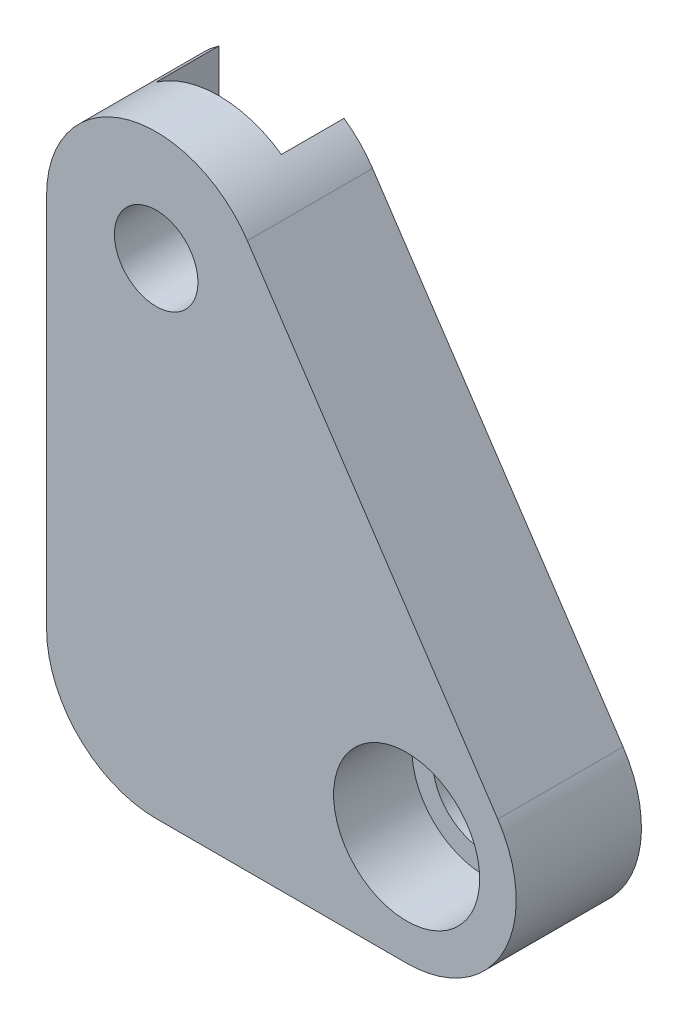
from build123d import *

# Parameters (mm, degrees)
EXTRUSION1_DEPTH                 = 24
ENL_V_MAT_EXTRU_1_REACH          = 133.799
ESQUISSE2_W                      = 24
ESQUISSE2_H                      = 12
DIAM_TRE_DU_PER_AGE_M16_0_16_1_D = 16
PER_AGE1_D                       = 20
PER_AGE1_CBORE_D                 = 28
PER_AGE1_CBORE_DEPTH             = 15
CONG_1_R                         = 21


with BuildPart() as part:
    # Esquisse1 → Extrusion1 (new body)
    with BuildSketch(Plane(origin=(0, 0, 6), x_dir=(-1, 0, 0), z_dir=(0, 0, -1))):
        with BuildLine():
            Line((31.050048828, -21), (31.050048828, 72))
            ThreePointArc((31.050048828, 72), (16.135515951, 92.098932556), (-7.423007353, 83.648704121))
            Line((-7.423007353, 83.648704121), (-55.423007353, 11.648704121))
            ThreePointArc((-55.423007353, 11.648704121), (-56.465117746, -9.909016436), (-37.949951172, -21))
            Line((-37.949951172, -21), (31.050048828, -21))
        make_face()
    extrude(amount=-EXTRUSION1_DEPTH)

    # Esquisse2 → Enl_v. mat.-Extru.1 (cut, up to next)
    with BuildSketch(Plane.XZ.offset(21), mode=Mode.PRIVATE) as enl_v_mat_extru_1_sk1:
        with Locations((-10.050048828, 12)):
            Rectangle(ESQUISSE2_W, ESQUISSE2_H)
    enl_v_mat_extru_1_tool1 = extrude(enl_v_mat_extru_1_sk1.sketch, amount=-ENL_V_MAT_EXTRU_1_REACH, mode=Mode.PRIVATE) & part.part
    add(enl_v_mat_extru_1_tool1.solids().sort_by_distance((-10.050049, -21, 12))[0], mode=Mode.SUBTRACT)

    # Diam_tre du per_age M16.0 _16_1 (through all)
    with Locations(Plane(origin=(0, 0, 18), x_dir=(-1, 0, 0), z_dir=(0, 0, -1))):
        with Locations((10.050048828, 72)):
            Hole(DIAM_TRE_DU_PER_AGE_M16_0_16_1_D / 2)

    # Per_age1 (through all)
    with Locations(Plane.XY.offset(30)):
        with Locations((37.949951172, 0)):
            CounterBoreHole(PER_AGE1_D / 2, PER_AGE1_CBORE_D / 2, PER_AGE1_CBORE_DEPTH)

    # Cong_1
    cong_1_edges = [part.edges().sort_by_distance(p)[0] for p in [
        (-31.050048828, -21, 18),
    ]]
    fillet(cong_1_edges, radius=CONG_1_R)


solid = part.part
